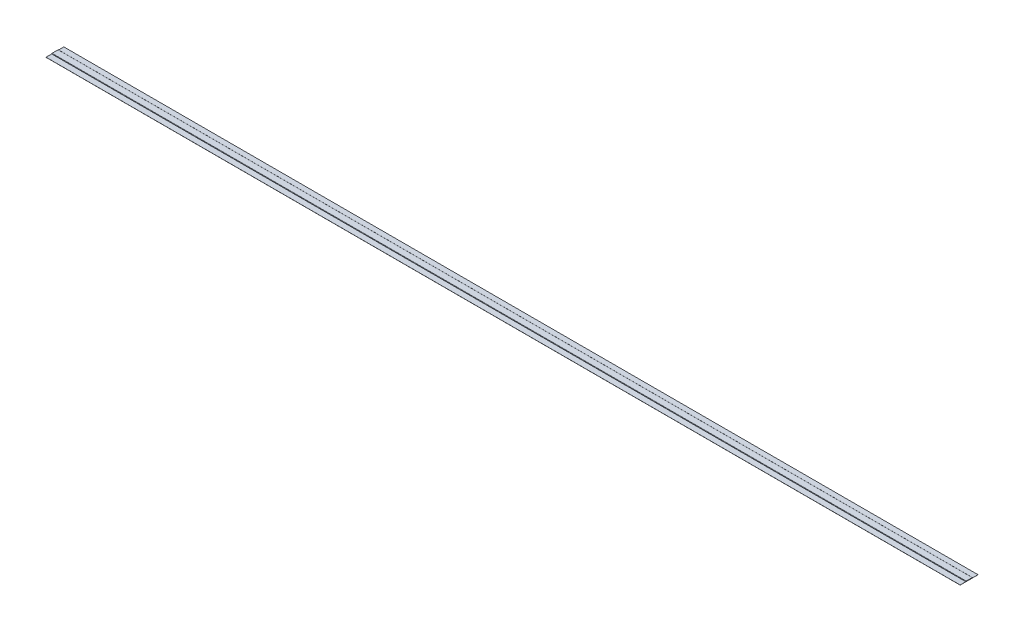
from build123d import *

# Parameters (mm, degrees)
SKETCH1_W           = 2438.4
SKETCH1_H           = 47.625
BOSS_EXTRUDE1_DEPTH = 0.254
BOSS_EXTRUDE2_DEPTH = 2438.4


with BuildPart() as part:
    # Sketch1 → Boss-Extrude1 (new body)
    with BuildSketch(Plane(origin=(0, 0, 0), x_dir=(1, 0, 0), z_dir=(0, 1, 0))):
        with Locations((609.6, 0)):
            Rectangle(SKETCH1_W, SKETCH1_H)
    extrude(amount=BOSS_EXTRUDE1_DEPTH)

    # Sketch2 → Boss-Extrude2 (add)
    with BuildSketch(Plane(origin=(1828.8, 0, 0), x_dir=(0, 0, -1), z_dir=(1, 0, 0))):
        with BuildLine():
            Line((8.380000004, 1.27), (-7.62, 1.27))
            ThreePointArc((-7.62, 1.27), (-8.33842049, 0.97242049), (-8.636, 0.254))
            Line((-8.636, 0.254), (9.396000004, 0.254))
            ThreePointArc((9.396000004, 0.254), (9.098420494, 0.97242049), (8.380000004, 1.27))
        make_face()
    extrude(amount=-BOSS_EXTRUDE2_DEPTH)


solid = part.part
